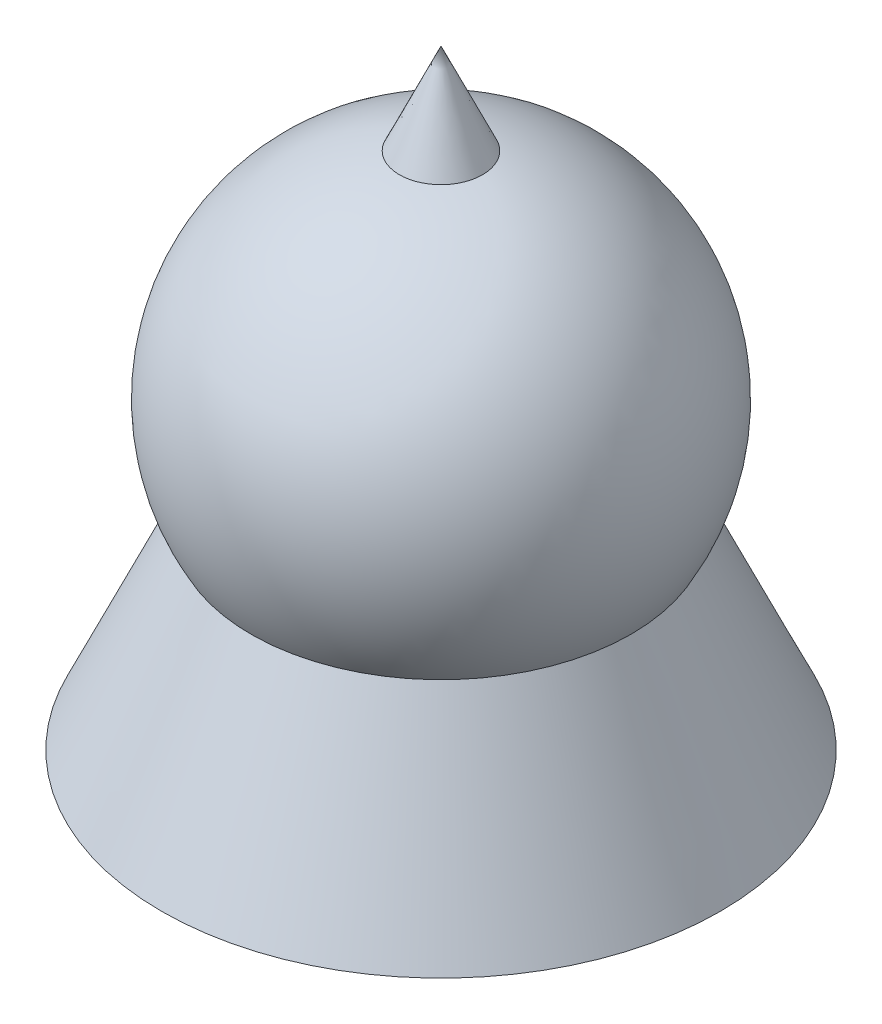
ISO-10303-21;
HEADER;
FILE_DESCRIPTION(('STEP AP214'),'2;1');
FILE_NAME('part.step','',(''),(''),'','','');
FILE_SCHEMA(('AUTOMOTIVE_DESIGN { 1 0 10303 214 1 1 1 1 }'));
ENDSEC;
DATA;
#1=APPLICATION_CONTEXT('core data for automotive mechanical design processes');
#2=APPLICATION_PROTOCOL_DEFINITION('international standard','automotive_design',2000,#1);
#3=PRODUCT_CONTEXT('',#1,'mechanical');
#4=PRODUCT('Part','Part','',(#3));
#5=PRODUCT_RELATED_PRODUCT_CATEGORY('part','',(#4));
#6=PRODUCT_DEFINITION_FORMATION('','',#4);
#7=PRODUCT_DEFINITION_CONTEXT('part definition',#1,'design');
#8=PRODUCT_DEFINITION('design','',#6,#7);
#9=PRODUCT_DEFINITION_SHAPE('','',#8);
#10=(LENGTH_UNIT() NAMED_UNIT(*) SI_UNIT(.MILLI.,.METRE.));
#11=(NAMED_UNIT(*) PLANE_ANGLE_UNIT() SI_UNIT($,.RADIAN.));
#12=(NAMED_UNIT(*) SI_UNIT($,.STERADIAN.) SOLID_ANGLE_UNIT());
#13=UNCERTAINTY_MEASURE_WITH_UNIT(LENGTH_MEASURE(1.E-05),#10,'distance_accuracy_value','');
#14=(GEOMETRIC_REPRESENTATION_CONTEXT(3) GLOBAL_UNCERTAINTY_ASSIGNED_CONTEXT((#13)) GLOBAL_UNIT_ASSIGNED_CONTEXT((#10,
#11,#12)) REPRESENTATION_CONTEXT('',''));
#15=CARTESIAN_POINT('',(0.,0.,0.));
#16=DIRECTION('',(0.,0.,1.));
#17=DIRECTION('',(1.,0.,0.));
#18=AXIS2_PLACEMENT_3D('',#15,#16,#17);
#19=CARTESIAN_POINT('',(0.,44.7357862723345,0.));
#20=DIRECTION('',(0.,-1.,0.));
#21=DIRECTION('',(0.,0.,-1.));
#22=AXIS2_PLACEMENT_3D('',#19,#20,#21);
#23=CONICAL_SURFACE('',#22,0.,0.429775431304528);
#24=CARTESIAN_POINT('',(0.,7.65284290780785,0.));
#25=DIRECTION('',(0.,1.,0.));
#26=DIRECTION('',(0.,0.,1.));
#27=AXIS2_PLACEMENT_3D('',#24,#25,#26);
#28=CIRCLE('',#27,16.9969392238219);
#29=CARTESIAN_POINT('',(16.9969392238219,7.65284290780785,0.));
#30=VERTEX_POINT('',#29);
#31=EDGE_CURVE('E36',#30,#30,#28,.T.);
#32=ORIENTED_EDGE('',*,*,#31,.F.);
#33=EDGE_LOOP('',(#32));
#34=FACE_BOUND('',#33,.T.);
#35=CARTESIAN_POINT('',(0.,-9.80777430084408,0.));
#36=DIRECTION('',(0.,1.,0.));
#37=DIRECTION('',(0.,0.,1.));
#38=AXIS2_PLACEMENT_3D('',#35,#36,#37);
#39=CIRCLE('',#38,25.);
#40=CARTESIAN_POINT('',(0.,-9.80777430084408,25.));
#41=VERTEX_POINT('',#40);
#42=EDGE_CURVE('E61',#41,#41,#39,.T.);
#43=ORIENTED_EDGE('',*,*,#42,.T.);
#44=EDGE_LOOP('',(#43));
#45=FACE_BOUND('',#44,.T.);
#46=ADVANCED_FACE('F30',(#34,#45),#23,.T.);
#47=CARTESIAN_POINT('',(-25.,-9.80777430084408,0.));
#48=DIRECTION('',(0.,-1.,0.));
#49=DIRECTION('',(0.,0.,-1.));
#50=AXIS2_PLACEMENT_3D('',#47,#48,#49);
#51=PLANE('',#50);
#52=ORIENTED_EDGE('',*,*,#42,.F.);
#53=EDGE_LOOP('',(#52));
#54=FACE_BOUND('',#53,.T.);
#55=ADVANCED_FACE('F46',(#54),#51,.T.);
#56=CARTESIAN_POINT('',(0.,17.3885131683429,0.));
#57=DIRECTION('',(0.,1.,0.));
#58=DIRECTION('',(1.,0.,0.));
#59=AXIS2_PLACEMENT_3D('',#56,#57,#58);
#60=SPHERICAL_SURFACE('',#59,19.5877313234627);
#61=CARTESIAN_POINT('',(0.,36.6197643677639,0.));
#62=DIRECTION('',(0.,-1.,0.));
#63=DIRECTION('',(0.,0.,-1.));
#64=AXIS2_PLACEMENT_3D('',#61,#62,#63);
#65=CIRCLE('',#64,3.71997254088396);
#66=CARTESIAN_POINT('',(3.71997254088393,36.6197643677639,0.));
#67=VERTEX_POINT('',#66);
#68=EDGE_CURVE('E11',#67,#67,#65,.T.);
#69=CARTESIAN_POINT('',(3.71997254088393,36.6197643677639,0.));
#70=CARTESIAN_POINT('',(4.10057338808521,36.546158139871,0.));
#71=CARTESIAN_POINT('',(4.47898185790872,36.4612257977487,0.));
#72=CARTESIAN_POINT('',(5.23009639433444,36.2690701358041,0.));
#73=CARTESIAN_POINT('',(5.60280246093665,36.1618468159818,0.));
#74=CARTESIAN_POINT('',(6.34119454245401,35.9254704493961,0.));
#75=CARTESIAN_POINT('',(6.70688055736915,35.7963174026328,0.));
#76=CARTESIAN_POINT('',(7.42994500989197,35.5165411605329,0.));
#77=CARTESIAN_POINT('',(7.78732344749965,35.3659179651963,0.));
#78=CARTESIAN_POINT('',(8.49251305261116,35.0437310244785,0.));
#79=CARTESIAN_POINT('',(8.840324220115,34.8721672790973,0.));
#80=CARTESIAN_POINT('',(9.52515369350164,34.5087041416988,0.));
#81=CARTESIAN_POINT('',(9.86217199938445,34.3168047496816,0.));
#82=CARTESIAN_POINT('',(10.5242280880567,33.9133464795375,0.));
#83=CARTESIAN_POINT('',(10.8492658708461,33.7017876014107,0.));
#84=CARTESIAN_POINT('',(11.4862154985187,33.2597559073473,0.));
#85=CARTESIAN_POINT('',(11.7981273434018,33.0292830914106,0.));
#86=CARTESIAN_POINT('',(12.4077259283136,32.5502356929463,0.));
#87=CARTESIAN_POINT('',(12.7054126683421,32.3016611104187,0.));
#88=CARTESIAN_POINT('',(13.2855120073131,31.7872861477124,0.));
#89=CARTESIAN_POINT('',(13.5679246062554,31.5214857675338,0.));
#90=CARTESIAN_POINT('',(14.1164804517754,30.9735958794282,0.));
#91=CARTESIAN_POINT('',(14.3826236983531,30.6915063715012,0.));
#92=CARTESIAN_POINT('',(14.8977029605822,30.1120323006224,0.));
#93=CARTESIAN_POINT('',(15.1466389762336,29.8146477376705,0.));
#94=CARTESIAN_POINT('',(15.6264265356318,29.2056315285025,0.));
#95=CARTESIAN_POINT('',(15.8572780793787,28.8939998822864,0.));
#96=CARTESIAN_POINT('',(16.3000831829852,28.2575876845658,0.));
#97=CARTESIAN_POINT('',(16.5120367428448,27.9328071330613,0.));
#98=CARTESIAN_POINT('',(16.9162989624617,27.2712416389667,0.));
#99=CARTESIAN_POINT('',(17.108607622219,26.9344566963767,0.));
#100=CARTESIAN_POINT('',(17.4729023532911,26.2500692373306,0.));
#101=CARTESIAN_POINT('',(17.644888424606,25.9024667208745,0.));
#102=CARTESIAN_POINT('',(17.9679319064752,25.1976690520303,0.));
#103=CARTESIAN_POINT('',(18.1189893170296,24.8404738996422,0.));
#104=CARTESIAN_POINT('',(18.3996431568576,24.1177497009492,0.));
#105=CARTESIAN_POINT('',(18.5292395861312,23.7522206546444,0.));
#106=CARTESIAN_POINT('',(18.7665147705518,23.014116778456,0.));
#107=CARTESIAN_POINT('',(18.8741935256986,22.6415419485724,0.));
#108=CARTESIAN_POINT('',(19.067253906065,21.8906594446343,0.));
#109=CARTESIAN_POINT('',(19.1526355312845,21.5123517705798,0.));
#110=CARTESIAN_POINT('',(19.3008007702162,20.7513367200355,0.));
#111=CARTESIAN_POINT('',(19.3635843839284,20.3686293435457,0.));
#112=CARTESIAN_POINT('',(19.4663323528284,19.6001635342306,0.));
#113=CARTESIAN_POINT('',(19.5062967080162,19.2144051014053,0.));
#114=CARTESIAN_POINT('',(19.5632653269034,18.4411965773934,0.));
#115=CARTESIAN_POINT('',(19.5802695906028,18.0537464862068,0.));
#116=CARTESIAN_POINT('',(19.5912581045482,17.2785200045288,0.));
#117=CARTESIAN_POINT('',(19.585242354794,16.8907436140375,0.));
#118=CARTESIAN_POINT('',(19.5502120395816,16.1162310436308,0.));
#119=CARTESIAN_POINT('',(19.5211974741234,15.7294948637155,0.));
#120=CARTESIAN_POINT('',(19.4402717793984,14.9584255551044,0.));
#121=CARTESIAN_POINT('',(19.3883606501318,14.5740924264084,0.));
#122=CARTESIAN_POINT('',(19.2618247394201,13.8091836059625,0.));
#123=CARTESIAN_POINT('',(19.187199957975,13.4286079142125,0.));
#124=CARTESIAN_POINT('',(19.0154997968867,12.6725550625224,0.));
#125=CARTESIAN_POINT('',(18.9184244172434,12.2970779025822,0.));
#126=CARTESIAN_POINT('',(18.7021648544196,11.5525454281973,0.));
#127=CARTESIAN_POINT('',(18.5829806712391,11.1834901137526,0.));
#128=CARTESIAN_POINT('',(18.3229246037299,10.4531013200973,0.));
#129=CARTESIAN_POINT('',(18.1820527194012,10.0917678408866,0.));
#130=CARTESIAN_POINT('',(17.8791135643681,9.37809808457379,0.));
#131=CARTESIAN_POINT('',(17.7170462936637,9.02576180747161,0.));
#132=CARTESIAN_POINT('',(17.3723028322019,8.33132045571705,0.));
#133=CARTESIAN_POINT('',(17.1896266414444,7.98921538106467,0.));
#134=CARTESIAN_POINT('',(16.9969392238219,7.65284290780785,0.));
#135=B_SPLINE_CURVE_WITH_KNOTS('',3,(#69,#70,#71,#72,#73,#74,#75,#76,#77,#78,#79,#80,#81,#82,
#83,#84,#85,#86,#87,#88,#89,#90,#91,#92,#93,#94,#95,#96,#97,#98,#99,#100,#101,#102,#103,#104,
#105,#106,#107,#108,#109,#110,#111,#112,#113,#114,#115,#116,#117,#118,#119,#120,#121,#122,#123,
#124,#125,#126,#127,#128,#129,#130,#131,#132,#133,#134),.UNSPECIFIED.,.F.,.F.,(4,2,2,2,2,2,2,2,
2,2,2,2,2,2,2,2,2,2,2,2,2,2,2,2,2,2,2,2,2,2,2,2,4),(0.,1.1627858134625,2.325571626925,
3.4883574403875,4.65114325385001,5.8139290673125,6.97671488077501,8.13950069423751,
9.30228650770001,10.4650723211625,11.627858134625,12.7906439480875,13.95342976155,
15.1162155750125,16.279001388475,17.4417872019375,18.6045730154,19.7673588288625,
20.930144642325,22.0929304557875,23.25571626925,24.4185020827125,25.581287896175,
26.7440737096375,27.9068595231,29.0696453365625,30.232431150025,31.3952169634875,32.55800277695,
33.7207885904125,34.883574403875,36.0463602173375,37.2091460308),.UNSPECIFIED.);
#136=EDGE_CURVE('BSEAM41',#67,#30,#135,.T.);
#137=ORIENTED_EDGE('',*,*,#68,.T.);
#138=ORIENTED_EDGE('',*,*,#31,.T.);
#139=ORIENTED_EDGE('',*,*,#136,.T.);
#140=ORIENTED_EDGE('',*,*,#136,.F.);
#141=EDGE_LOOP('',(#137,#139,#138,#140));
#142=FACE_BOUND('',#141,.T.);
#143=ADVANCED_FACE('F41',(#142),#60,.T.);
#144=ORIENTED_EDGE('',*,*,#68,.F.);
#145=EDGE_LOOP('',(#144));
#146=FACE_BOUND('',#145,.T.);
#147=CARTESIAN_POINT('',(0.,44.7357862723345,0.));
#148=VERTEX_POINT('',#147);
#149=VERTEX_LOOP('',#148);
#150=FACE_BOUND('',#149,.T.);
#151=ADVANCED_FACE('F39',(#146,#150),#23,.T.);
#152=CLOSED_SHELL('',(#46,#55,#143,#151));
#153=MANIFOLD_SOLID_BREP('B2',#152);
#154=ADVANCED_BREP_SHAPE_REPRESENTATION('',(#18,#153),#14);
#155=SHAPE_DEFINITION_REPRESENTATION(#9,#154);
ENDSEC;
END-ISO-10303-21;
